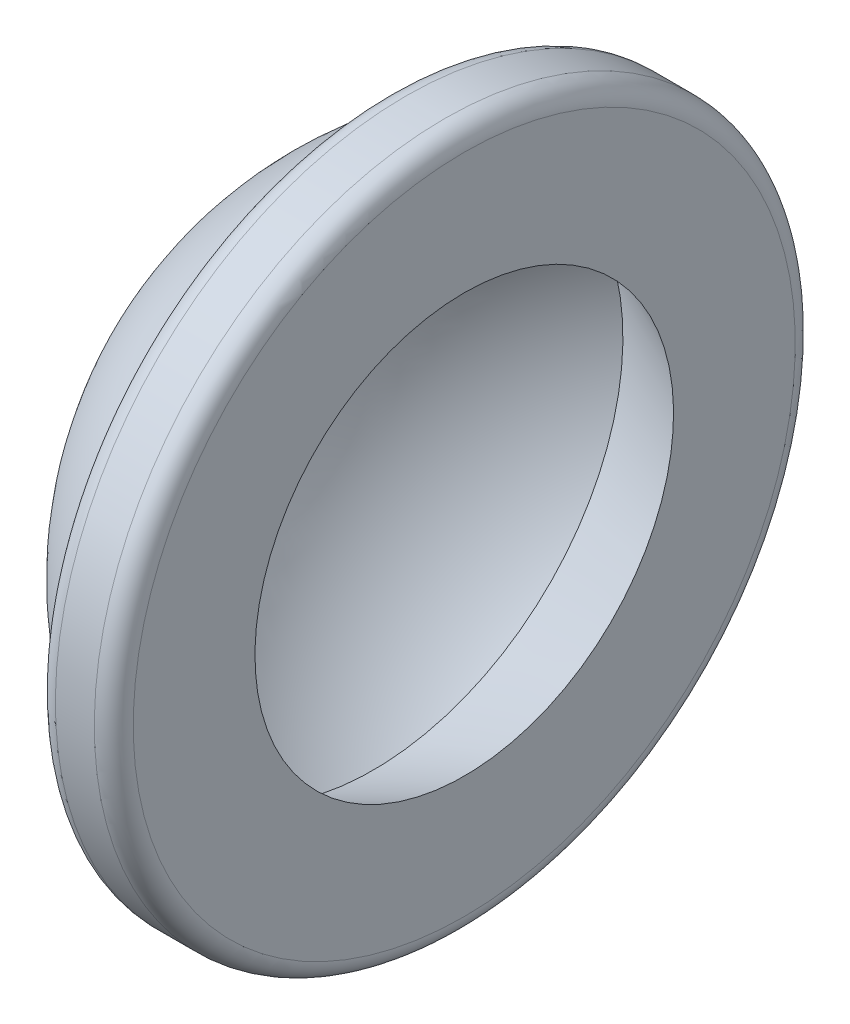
ISO-10303-21;
HEADER;
FILE_DESCRIPTION(('STEP AP214'),'2;1');
FILE_NAME('part.step','',(''),(''),'','','');
FILE_SCHEMA(('AUTOMOTIVE_DESIGN { 1 0 10303 214 1 1 1 1 }'));
ENDSEC;
DATA;
#1=APPLICATION_CONTEXT('core data for automotive mechanical design processes');
#2=APPLICATION_PROTOCOL_DEFINITION('international standard','automotive_design',2000,#1);
#3=PRODUCT_CONTEXT('',#1,'mechanical');
#4=PRODUCT('Part','Part','',(#3));
#5=PRODUCT_RELATED_PRODUCT_CATEGORY('part','',(#4));
#6=PRODUCT_DEFINITION_FORMATION('','',#4);
#7=PRODUCT_DEFINITION_CONTEXT('part definition',#1,'design');
#8=PRODUCT_DEFINITION('design','',#6,#7);
#9=PRODUCT_DEFINITION_SHAPE('','',#8);
#10=(LENGTH_UNIT() NAMED_UNIT(*) SI_UNIT(.MILLI.,.METRE.));
#11=(NAMED_UNIT(*) PLANE_ANGLE_UNIT() SI_UNIT($,.RADIAN.));
#12=(NAMED_UNIT(*) SI_UNIT($,.STERADIAN.) SOLID_ANGLE_UNIT());
#13=UNCERTAINTY_MEASURE_WITH_UNIT(LENGTH_MEASURE(1.E-05),#10,'distance_accuracy_value','');
#14=(GEOMETRIC_REPRESENTATION_CONTEXT(3) GLOBAL_UNCERTAINTY_ASSIGNED_CONTEXT((#13)) GLOBAL_UNIT_ASSIGNED_CONTEXT((#10,
#11,#12)) REPRESENTATION_CONTEXT('',''));
#15=CARTESIAN_POINT('',(0.,0.,0.));
#16=DIRECTION('',(0.,0.,1.));
#17=DIRECTION('',(1.,0.,0.));
#18=AXIS2_PLACEMENT_3D('',#15,#16,#17);
#19=CARTESIAN_POINT('',(-4.68710187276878,0.,0.));
#20=DIRECTION('',(-1.,0.,0.));
#21=DIRECTION('',(0.,-1.,0.));
#22=AXIS2_PLACEMENT_3D('',#19,#20,#21);
#23=CONICAL_SURFACE('',#22,12.83683220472,0.41887902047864);
#24=CARTESIAN_POINT('',(0.,0.,0.));
#25=DIRECTION('',(1.,0.,0.));
#26=DIRECTION('',(0.,1.,0.));
#27=AXIS2_PLACEMENT_3D('',#24,#25,#26);
#28=CIRCLE('',#27,10.75);
#29=CARTESIAN_POINT('',(0.,10.75,0.));
#30=VERTEX_POINT('',#29);
#31=EDGE_CURVE('E10',#30,#30,#28,.T.);
#32=ORIENTED_EDGE('',*,*,#31,.T.);
#33=EDGE_LOOP('',(#32));
#34=FACE_BOUND('',#33,.T.);
#35=CARTESIAN_POINT('',(-4.68710187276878,0.,0.));
#36=DIRECTION('',(1.,0.,0.));
#37=DIRECTION('',(0.,1.,0.));
#38=AXIS2_PLACEMENT_3D('',#35,#36,#37);
#39=CIRCLE('',#38,12.83683220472);
#40=CARTESIAN_POINT('',(-4.68710187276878,12.83683220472,0.));
#41=VERTEX_POINT('',#40);
#42=EDGE_CURVE('E376',#41,#41,#39,.T.);
#43=ORIENTED_EDGE('',*,*,#42,.F.);
#44=EDGE_LOOP('',(#43));
#45=FACE_BOUND('',#44,.T.);
#46=ADVANCED_FACE('F348',(#34,#45),#23,.F.);
#47=CARTESIAN_POINT('',(0.,10.75,0.));
#48=DIRECTION('',(1.,0.,0.));
#49=DIRECTION('',(0.,1.,0.));
#50=AXIS2_PLACEMENT_3D('',#47,#48,#49);
#51=PLANE('',#50);
#52=CARTESIAN_POINT('',(0.,0.,0.));
#53=DIRECTION('',(1.,0.,0.));
#54=DIRECTION('',(0.,1.,0.));
#55=AXIS2_PLACEMENT_3D('',#52,#53,#54);
#56=CIRCLE('',#55,17.);
#57=CARTESIAN_POINT('',(0.,17.,0.));
#58=VERTEX_POINT('',#57);
#59=EDGE_CURVE('E354',#58,#58,#56,.T.);
#60=ORIENTED_EDGE('',*,*,#59,.T.);
#61=EDGE_LOOP('',(#60));
#62=FACE_BOUND('',#61,.T.);
#63=ORIENTED_EDGE('',*,*,#31,.F.);
#64=EDGE_LOOP('',(#63));
#65=FACE_BOUND('',#64,.T.);
#66=ADVANCED_FACE('F383',(#62,#65),#51,.T.);
#67=CARTESIAN_POINT('',(-0.999999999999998,0.,0.));
#68=DIRECTION('',(1.,0.,0.));
#69=DIRECTION('',(0.,1.,0.));
#70=AXIS2_PLACEMENT_3D('',#67,#68,#69);
#71=TOROIDAL_SURFACE('',#70,17.,1.);
#72=CARTESIAN_POINT('',(-1.,0.,0.));
#73=DIRECTION('',(1.,0.,0.));
#74=DIRECTION('',(0.,1.,0.));
#75=AXIS2_PLACEMENT_3D('',#72,#73,#74);
#76=CIRCLE('',#75,18.);
#77=CARTESIAN_POINT('',(-1.00000000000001,18.,0.));
#78=VERTEX_POINT('',#77);
#79=EDGE_CURVE('E358',#78,#78,#76,.T.);
#80=ORIENTED_EDGE('',*,*,#79,.T.);
#81=EDGE_LOOP('',(#80));
#82=FACE_BOUND('',#81,.T.);
#83=ORIENTED_EDGE('',*,*,#59,.F.);
#84=EDGE_LOOP('',(#83));
#85=FACE_BOUND('',#84,.T.);
#86=ADVANCED_FACE('F387',(#82,#85),#71,.T.);
#87=CARTESIAN_POINT('',(0.,0.,0.));
#88=DIRECTION('',(1.,0.,0.));
#89=DIRECTION('',(0.,1.,0.));
#90=AXIS2_PLACEMENT_3D('',#87,#88,#89);
#91=CYLINDRICAL_SURFACE('',#90,18.);
#92=CARTESIAN_POINT('',(-2.99999999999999,0.,0.));
#93=DIRECTION('',(1.,0.,0.));
#94=DIRECTION('',(0.,1.,0.));
#95=AXIS2_PLACEMENT_3D('',#92,#93,#94);
#96=CIRCLE('',#95,18.);
#97=CARTESIAN_POINT('',(-2.99999999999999,18.,0.));
#98=VERTEX_POINT('',#97);
#99=EDGE_CURVE('E362',#98,#98,#96,.T.);
#100=ORIENTED_EDGE('',*,*,#99,.T.);
#101=EDGE_LOOP('',(#100));
#102=FACE_BOUND('',#101,.T.);
#103=ORIENTED_EDGE('',*,*,#79,.F.);
#104=EDGE_LOOP('',(#103));
#105=FACE_BOUND('',#104,.T.);
#106=ADVANCED_FACE('F391',(#102,#105),#91,.T.);
#107=CARTESIAN_POINT('',(-3.,0.,0.));
#108=DIRECTION('',(1.,0.,0.));
#109=DIRECTION('',(0.,1.,0.));
#110=AXIS2_PLACEMENT_3D('',#107,#108,#109);
#111=TOROIDAL_SURFACE('',#110,17.,1.);
#112=CARTESIAN_POINT('',(-4.,0.,0.));
#113=DIRECTION('',(1.,0.,0.));
#114=DIRECTION('',(0.,1.,0.));
#115=AXIS2_PLACEMENT_3D('',#112,#113,#114);
#116=CIRCLE('',#115,17.);
#117=CARTESIAN_POINT('',(-4.,17.,0.));
#118=VERTEX_POINT('',#117);
#119=EDGE_CURVE('E367',#118,#118,#116,.T.);
#120=ORIENTED_EDGE('',*,*,#119,.T.);
#121=EDGE_LOOP('',(#120));
#122=FACE_BOUND('',#121,.T.);
#123=ORIENTED_EDGE('',*,*,#99,.F.);
#124=EDGE_LOOP('',(#123));
#125=FACE_BOUND('',#124,.T.);
#126=ADVANCED_FACE('F398',(#122,#125),#111,.T.);
#127=CARTESIAN_POINT('',(-4.,17.,0.));
#128=DIRECTION('',(-1.,0.,0.));
#129=DIRECTION('',(0.,-1.,0.));
#130=AXIS2_PLACEMENT_3D('',#127,#128,#129);
#131=PLANE('',#130);
#132=CARTESIAN_POINT('',(-4.,0.,0.));
#133=DIRECTION('',(1.,0.,0.));
#134=DIRECTION('',(0.,1.,0.));
#135=AXIS2_PLACEMENT_3D('',#132,#133,#134);
#136=CIRCLE('',#135,16.7332005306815);
#137=CARTESIAN_POINT('',(-4.,16.7332005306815,0.));
#138=VERTEX_POINT('',#137);
#139=EDGE_CURVE('E370',#138,#138,#136,.T.);
#140=ORIENTED_EDGE('',*,*,#139,.T.);
#141=EDGE_LOOP('',(#140));
#142=FACE_BOUND('',#141,.T.);
#143=ORIENTED_EDGE('',*,*,#119,.F.);
#144=EDGE_LOOP('',(#143));
#145=FACE_BOUND('',#144,.T.);
#146=ADVANCED_FACE('F402',(#142,#145),#131,.T.);
#147=CARTESIAN_POINT('',(-5.,0.,0.));
#148=DIRECTION('',(1.,0.,0.));
#149=DIRECTION('',(0.,1.,0.));
#150=AXIS2_PLACEMENT_3D('',#147,#148,#149);
#151=TOROIDAL_SURFACE('',#150,16.7332005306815,1.);
#152=CARTESIAN_POINT('',(-4.52631578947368,0.,0.));
#153=DIRECTION('',(1.,0.,0.));
#154=DIRECTION('',(0.,1.,0.));
#155=AXIS2_PLACEMENT_3D('',#152,#153,#154);
#156=CIRCLE('',#155,15.8525057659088);
#157=CARTESIAN_POINT('',(-4.52631578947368,15.8525057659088,0.));
#158=VERTEX_POINT('',#157);
#159=EDGE_CURVE('E373',#158,#158,#156,.T.);
#160=ORIENTED_EDGE('',*,*,#159,.T.);
#161=EDGE_LOOP('',(#160));
#162=FACE_BOUND('',#161,.T.);
#163=ORIENTED_EDGE('',*,*,#139,.F.);
#164=EDGE_LOOP('',(#163));
#165=FACE_BOUND('',#164,.T.);
#166=ADVANCED_FACE('F406',(#162,#165),#151,.F.);
#167=CARTESIAN_POINT('',(4.,0.,0.));
#168=DIRECTION('',(1.,0.,0.));
#169=DIRECTION('',(0.,1.,0.));
#170=AXIS2_PLACEMENT_3D('',#167,#168,#169);
#171=SPHERICAL_SURFACE('',#170,18.);
#172=ORIENTED_EDGE('',*,*,#159,.F.);
#173=EDGE_LOOP('',(#172));
#174=FACE_BOUND('',#173,.T.);
#175=ADVANCED_FACE('F410',(#174),#171,.T.);
#176=CARTESIAN_POINT('',(4.,0.,0.));
#177=DIRECTION('',(1.,0.,0.));
#178=DIRECTION('',(0.,1.,0.));
#179=AXIS2_PLACEMENT_3D('',#176,#177,#178);
#180=SPHERICAL_SURFACE('',#179,15.5);
#181=ORIENTED_EDGE('',*,*,#42,.T.);
#182=EDGE_LOOP('',(#181));
#183=FACE_BOUND('',#182,.T.);
#184=ADVANCED_FACE('F380',(#183),#180,.F.);
#185=CLOSED_SHELL('',(#46,#66,#86,#106,#126,#146,#166,#175,#184));
#186=MANIFOLD_SOLID_BREP('B2',#185);
#187=ADVANCED_BREP_SHAPE_REPRESENTATION('',(#18,#186),#14);
#188=SHAPE_DEFINITION_REPRESENTATION(#9,#187);
ENDSEC;
END-ISO-10303-21;
